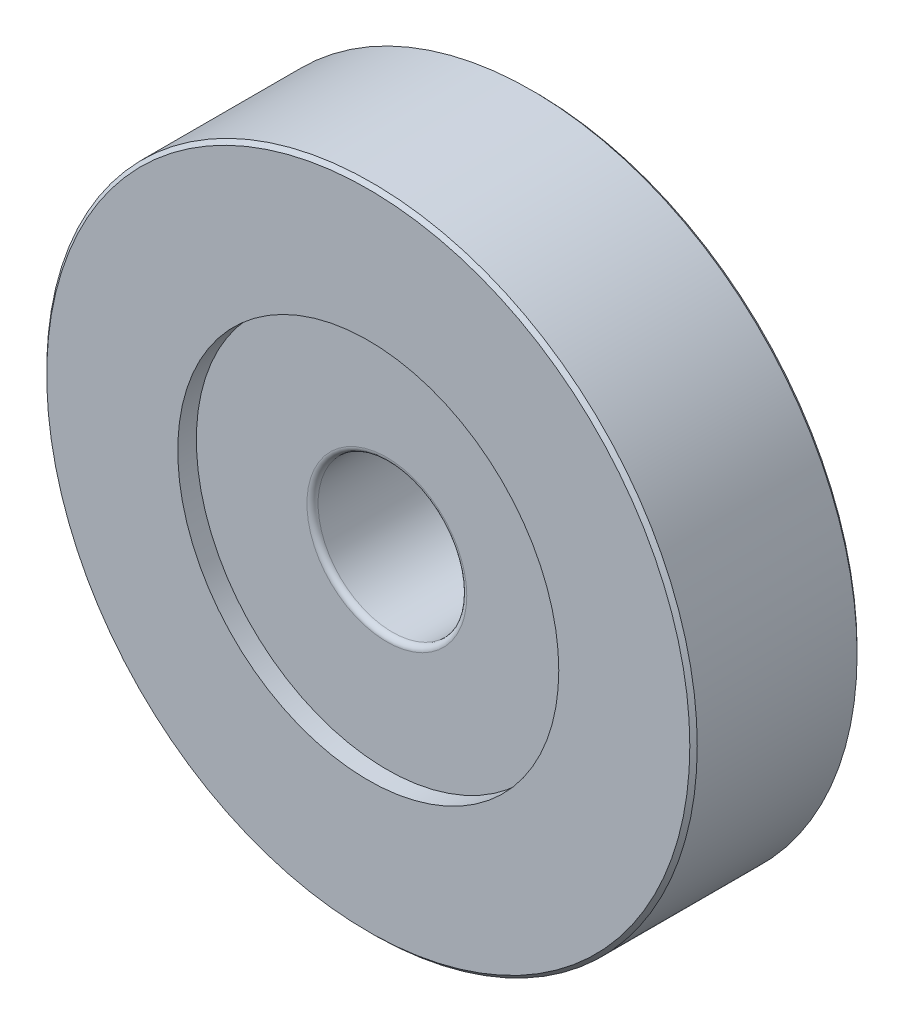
ISO-10303-21;
HEADER;
FILE_DESCRIPTION(('STEP AP214'),'2;1');
FILE_NAME('part.step','',(''),(''),'','','');
FILE_SCHEMA(('AUTOMOTIVE_DESIGN { 1 0 10303 214 1 1 1 1 }'));
ENDSEC;
DATA;
#1=APPLICATION_CONTEXT('core data for automotive mechanical design processes');
#2=APPLICATION_PROTOCOL_DEFINITION('international standard','automotive_design',2000,#1);
#3=PRODUCT_CONTEXT('',#1,'mechanical');
#4=PRODUCT('Part','Part','',(#3));
#5=PRODUCT_RELATED_PRODUCT_CATEGORY('part','',(#4));
#6=PRODUCT_DEFINITION_FORMATION('','',#4);
#7=PRODUCT_DEFINITION_CONTEXT('part definition',#1,'design');
#8=PRODUCT_DEFINITION('design','',#6,#7);
#9=PRODUCT_DEFINITION_SHAPE('','',#8);
#10=(LENGTH_UNIT() NAMED_UNIT(*) SI_UNIT(.MILLI.,.METRE.));
#11=(NAMED_UNIT(*) PLANE_ANGLE_UNIT() SI_UNIT($,.RADIAN.));
#12=(NAMED_UNIT(*) SI_UNIT($,.STERADIAN.) SOLID_ANGLE_UNIT());
#13=UNCERTAINTY_MEASURE_WITH_UNIT(LENGTH_MEASURE(1.E-05),#10,'distance_accuracy_value','');
#14=(GEOMETRIC_REPRESENTATION_CONTEXT(3) GLOBAL_UNCERTAINTY_ASSIGNED_CONTEXT((#13)) GLOBAL_UNIT_ASSIGNED_CONTEXT((#10,
#11,#12)) REPRESENTATION_CONTEXT('',''));
#15=CARTESIAN_POINT('',(0.,0.,0.));
#16=DIRECTION('',(0.,0.,1.));
#17=DIRECTION('',(1.,0.,0.));
#18=AXIS2_PLACEMENT_3D('',#15,#16,#17);
#19=CARTESIAN_POINT('',(0.,0.,3.2));
#20=DIRECTION('',(0.,0.,1.));
#21=DIRECTION('',(1.,0.,0.));
#22=AXIS2_PLACEMENT_3D('',#19,#20,#21);
#23=TOROIDAL_SURFACE('',#22,4.3,0.299999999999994);
#24=CARTESIAN_POINT('',(0.,0.,3.2));
#25=DIRECTION('',(0.,0.,1.));
#26=DIRECTION('',(1.,0.,0.));
#27=AXIS2_PLACEMENT_3D('',#24,#25,#26);
#28=CIRCLE('',#27,4.);
#29=CARTESIAN_POINT('',(4.,0.,3.2));
#30=VERTEX_POINT('',#29);
#31=EDGE_CURVE('E8',#30,#30,#28,.T.);
#32=ORIENTED_EDGE('',*,*,#31,.F.);
#33=EDGE_LOOP('',(#32));
#34=FACE_BOUND('',#33,.T.);
#35=CARTESIAN_POINT('',(0.,0.,3.5));
#36=DIRECTION('',(0.,0.,1.));
#37=DIRECTION('',(1.,0.,0.));
#38=AXIS2_PLACEMENT_3D('',#35,#36,#37);
#39=CIRCLE('',#38,4.3);
#40=CARTESIAN_POINT('',(4.3,0.,3.5));
#41=VERTEX_POINT('',#40);
#42=EDGE_CURVE('E52',#41,#41,#39,.T.);
#43=ORIENTED_EDGE('',*,*,#42,.T.);
#44=EDGE_LOOP('',(#43));
#45=FACE_BOUND('',#44,.T.);
#46=ADVANCED_FACE('F12',(#34,#45),#23,.T.);
#47=CARTESIAN_POINT('',(0.,0.,7.5));
#48=DIRECTION('',(0.,0.,1.));
#49=DIRECTION('',(1.,0.,0.));
#50=AXIS2_PLACEMENT_3D('',#47,#48,#49);
#51=CYLINDRICAL_SURFACE('',#50,4.);
#52=CARTESIAN_POINT('',(0.,0.,-3.2));
#53=DIRECTION('',(0.,0.,1.));
#54=DIRECTION('',(1.,0.,0.));
#55=AXIS2_PLACEMENT_3D('',#52,#53,#54);
#56=CIRCLE('',#55,4.);
#57=CARTESIAN_POINT('',(4.,0.,-3.2));
#58=VERTEX_POINT('',#57);
#59=EDGE_CURVE('E18',#58,#58,#56,.T.);
#60=ORIENTED_EDGE('',*,*,#59,.F.);
#61=EDGE_LOOP('',(#60));
#62=FACE_BOUND('',#61,.T.);
#63=ORIENTED_EDGE('',*,*,#31,.T.);
#64=EDGE_LOOP('',(#63));
#65=FACE_BOUND('',#64,.T.);
#66=ADVANCED_FACE('F113',(#62,#65),#51,.F.);
#67=CARTESIAN_POINT('',(0.,0.,-3.2));
#68=DIRECTION('',(0.,0.,1.));
#69=DIRECTION('',(1.,0.,0.));
#70=AXIS2_PLACEMENT_3D('',#67,#68,#69);
#71=TOROIDAL_SURFACE('',#70,4.3,0.300000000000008);
#72=CARTESIAN_POINT('',(0.,0.,-3.5));
#73=DIRECTION('',(0.,0.,1.));
#74=DIRECTION('',(1.,0.,0.));
#75=AXIS2_PLACEMENT_3D('',#72,#73,#74);
#76=CIRCLE('',#75,4.3);
#77=CARTESIAN_POINT('',(4.3,0.,-3.5));
#78=VERTEX_POINT('',#77);
#79=EDGE_CURVE('E22',#78,#78,#76,.T.);
#80=ORIENTED_EDGE('',*,*,#79,.F.);
#81=EDGE_LOOP('',(#80));
#82=FACE_BOUND('',#81,.T.);
#83=ORIENTED_EDGE('',*,*,#59,.T.);
#84=EDGE_LOOP('',(#83));
#85=FACE_BOUND('',#84,.T.);
#86=ADVANCED_FACE('F108',(#82,#85),#71,.T.);
#87=CARTESIAN_POINT('',(0.,4.3,-3.5));
#88=DIRECTION('',(0.,0.,1.));
#89=DIRECTION('',(1.,0.,0.));
#90=AXIS2_PLACEMENT_3D('',#87,#88,#89);
#91=PLANE('',#90);
#92=CARTESIAN_POINT('',(0.,0.,-3.5));
#93=DIRECTION('',(0.,0.,1.));
#94=DIRECTION('',(1.,0.,0.));
#95=AXIS2_PLACEMENT_3D('',#92,#93,#94);
#96=CIRCLE('',#95,10.25);
#97=CARTESIAN_POINT('',(10.25,0.,-3.5));
#98=VERTEX_POINT('',#97);
#99=EDGE_CURVE('E26',#98,#98,#96,.T.);
#100=ORIENTED_EDGE('',*,*,#99,.F.);
#101=EDGE_LOOP('',(#100));
#102=FACE_BOUND('',#101,.T.);
#103=ORIENTED_EDGE('',*,*,#79,.T.);
#104=EDGE_LOOP('',(#103));
#105=FACE_BOUND('',#104,.T.);
#106=ADVANCED_FACE('F102',(#102,#105),#91,.F.);
#107=CARTESIAN_POINT('',(0.,0.,7.5));
#108=DIRECTION('',(0.,0.,1.));
#109=DIRECTION('',(1.,0.,0.));
#110=AXIS2_PLACEMENT_3D('',#107,#108,#109);
#111=CYLINDRICAL_SURFACE('',#110,10.25);
#112=CARTESIAN_POINT('',(0.,0.,-4.5));
#113=DIRECTION('',(0.,0.,1.));
#114=DIRECTION('',(1.,0.,0.));
#115=AXIS2_PLACEMENT_3D('',#112,#113,#114);
#116=CIRCLE('',#115,10.25);
#117=CARTESIAN_POINT('',(10.25,0.,-4.5));
#118=VERTEX_POINT('',#117);
#119=EDGE_CURVE('E31',#118,#118,#116,.T.);
#120=ORIENTED_EDGE('',*,*,#119,.F.);
#121=EDGE_LOOP('',(#120));
#122=FACE_BOUND('',#121,.T.);
#123=ORIENTED_EDGE('',*,*,#99,.T.);
#124=EDGE_LOOP('',(#123));
#125=FACE_BOUND('',#124,.T.);
#126=ADVANCED_FACE('F96',(#122,#125),#111,.F.);
#127=CARTESIAN_POINT('',(0.,17.3,-4.5));
#128=DIRECTION('',(0.,0.,1.));
#129=DIRECTION('',(1.,0.,0.));
#130=AXIS2_PLACEMENT_3D('',#127,#128,#129);
#131=PLANE('',#130);
#132=CARTESIAN_POINT('',(0.,0.,-4.5));
#133=DIRECTION('',(0.,0.,1.));
#134=DIRECTION('',(1.,0.,0.));
#135=AXIS2_PLACEMENT_3D('',#132,#133,#134);
#136=CIRCLE('',#135,17.3);
#137=CARTESIAN_POINT('',(17.3,0.,-4.5));
#138=VERTEX_POINT('',#137);
#139=EDGE_CURVE('E34',#138,#138,#136,.T.);
#140=ORIENTED_EDGE('',*,*,#139,.F.);
#141=EDGE_LOOP('',(#140));
#142=FACE_BOUND('',#141,.T.);
#143=ORIENTED_EDGE('',*,*,#119,.T.);
#144=EDGE_LOOP('',(#143));
#145=FACE_BOUND('',#144,.T.);
#146=ADVANCED_FACE('F90',(#142,#145),#131,.F.);
#147=CARTESIAN_POINT('',(0.,0.,-4.5));
#148=DIRECTION('',(0.,0.,1.));
#149=DIRECTION('',(1.,0.,0.));
#150=AXIS2_PLACEMENT_3D('',#147,#148,#149);
#151=CONICAL_SURFACE('',#150,17.3,0.785398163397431);
#152=CARTESIAN_POINT('',(0.,0.,-4.3));
#153=DIRECTION('',(0.,0.,1.));
#154=DIRECTION('',(1.,0.,0.));
#155=AXIS2_PLACEMENT_3D('',#152,#153,#154);
#156=CIRCLE('',#155,17.5);
#157=CARTESIAN_POINT('',(17.5,0.,-4.3));
#158=VERTEX_POINT('',#157);
#159=EDGE_CURVE('E37',#158,#158,#156,.T.);
#160=ORIENTED_EDGE('',*,*,#159,.F.);
#161=EDGE_LOOP('',(#160));
#162=FACE_BOUND('',#161,.T.);
#163=ORIENTED_EDGE('',*,*,#139,.T.);
#164=EDGE_LOOP('',(#163));
#165=FACE_BOUND('',#164,.T.);
#166=ADVANCED_FACE('F84',(#162,#165),#151,.T.);
#167=CARTESIAN_POINT('',(0.,0.,7.5));
#168=DIRECTION('',(0.,0.,1.));
#169=DIRECTION('',(1.,0.,0.));
#170=AXIS2_PLACEMENT_3D('',#167,#168,#169);
#171=CYLINDRICAL_SURFACE('',#170,17.5);
#172=CARTESIAN_POINT('',(0.,0.,4.3));
#173=DIRECTION('',(0.,0.,1.));
#174=DIRECTION('',(1.,0.,0.));
#175=AXIS2_PLACEMENT_3D('',#172,#173,#174);
#176=CIRCLE('',#175,17.5);
#177=CARTESIAN_POINT('',(17.5,0.,4.3));
#178=VERTEX_POINT('',#177);
#179=EDGE_CURVE('E40',#178,#178,#176,.T.);
#180=ORIENTED_EDGE('',*,*,#179,.F.);
#181=EDGE_LOOP('',(#180));
#182=FACE_BOUND('',#181,.T.);
#183=ORIENTED_EDGE('',*,*,#159,.T.);
#184=EDGE_LOOP('',(#183));
#185=FACE_BOUND('',#184,.T.);
#186=ADVANCED_FACE('F78',(#182,#185),#171,.T.);
#187=CARTESIAN_POINT('',(0.,0.,4.3));
#188=DIRECTION('',(0.,0.,-1.));
#189=DIRECTION('',(-1.,0.,0.));
#190=AXIS2_PLACEMENT_3D('',#187,#188,#189);
#191=CONICAL_SURFACE('',#190,17.5,0.7853981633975);
#192=CARTESIAN_POINT('',(0.,0.,4.5));
#193=DIRECTION('',(0.,0.,1.));
#194=DIRECTION('',(1.,0.,0.));
#195=AXIS2_PLACEMENT_3D('',#192,#193,#194);
#196=CIRCLE('',#195,17.3);
#197=CARTESIAN_POINT('',(17.3,0.,4.5));
#198=VERTEX_POINT('',#197);
#199=EDGE_CURVE('E43',#198,#198,#196,.T.);
#200=ORIENTED_EDGE('',*,*,#199,.F.);
#201=EDGE_LOOP('',(#200));
#202=FACE_BOUND('',#201,.T.);
#203=ORIENTED_EDGE('',*,*,#179,.T.);
#204=EDGE_LOOP('',(#203));
#205=FACE_BOUND('',#204,.T.);
#206=ADVANCED_FACE('F72',(#202,#205),#191,.T.);
#207=CARTESIAN_POINT('',(0.,17.3,4.5));
#208=DIRECTION('',(0.,0.,-1.));
#209=DIRECTION('',(-1.,0.,0.));
#210=AXIS2_PLACEMENT_3D('',#207,#208,#209);
#211=PLANE('',#210);
#212=CARTESIAN_POINT('',(0.,0.,4.5));
#213=DIRECTION('',(0.,0.,1.));
#214=DIRECTION('',(1.,0.,0.));
#215=AXIS2_PLACEMENT_3D('',#212,#213,#214);
#216=CIRCLE('',#215,10.25);
#217=CARTESIAN_POINT('',(10.25,0.,4.5));
#218=VERTEX_POINT('',#217);
#219=EDGE_CURVE('E46',#218,#218,#216,.T.);
#220=ORIENTED_EDGE('',*,*,#219,.F.);
#221=EDGE_LOOP('',(#220));
#222=FACE_BOUND('',#221,.T.);
#223=ORIENTED_EDGE('',*,*,#199,.T.);
#224=EDGE_LOOP('',(#223));
#225=FACE_BOUND('',#224,.T.);
#226=ADVANCED_FACE('F66',(#222,#225),#211,.F.);
#227=CARTESIAN_POINT('',(0.,0.,7.5));
#228=DIRECTION('',(0.,0.,1.));
#229=DIRECTION('',(1.,0.,0.));
#230=AXIS2_PLACEMENT_3D('',#227,#228,#229);
#231=CYLINDRICAL_SURFACE('',#230,10.25);
#232=CARTESIAN_POINT('',(0.,0.,3.5));
#233=DIRECTION('',(0.,0.,1.));
#234=DIRECTION('',(1.,0.,0.));
#235=AXIS2_PLACEMENT_3D('',#232,#233,#234);
#236=CIRCLE('',#235,10.25);
#237=CARTESIAN_POINT('',(10.25,0.,3.5));
#238=VERTEX_POINT('',#237);
#239=EDGE_CURVE('E49',#238,#238,#236,.T.);
#240=ORIENTED_EDGE('',*,*,#239,.F.);
#241=EDGE_LOOP('',(#240));
#242=FACE_BOUND('',#241,.T.);
#243=ORIENTED_EDGE('',*,*,#219,.T.);
#244=EDGE_LOOP('',(#243));
#245=FACE_BOUND('',#244,.T.);
#246=ADVANCED_FACE('F60',(#242,#245),#231,.F.);
#247=CARTESIAN_POINT('',(0.,10.25,3.5));
#248=DIRECTION('',(0.,0.,-1.));
#249=DIRECTION('',(-1.,0.,0.));
#250=AXIS2_PLACEMENT_3D('',#247,#248,#249);
#251=PLANE('',#250);
#252=ORIENTED_EDGE('',*,*,#42,.F.);
#253=EDGE_LOOP('',(#252));
#254=FACE_BOUND('',#253,.T.);
#255=ORIENTED_EDGE('',*,*,#239,.T.);
#256=EDGE_LOOP('',(#255));
#257=FACE_BOUND('',#256,.T.);
#258=ADVANCED_FACE('F57',(#254,#257),#251,.F.);
#259=CLOSED_SHELL('',(#46,#66,#86,#106,#126,#146,#166,#186,#206,#226,#246,#258));
#260=MANIFOLD_SOLID_BREP('B1',#259);
#261=ADVANCED_BREP_SHAPE_REPRESENTATION('',(#18,#260),#14);
#262=SHAPE_DEFINITION_REPRESENTATION(#9,#261);
ENDSEC;
END-ISO-10303-21;
